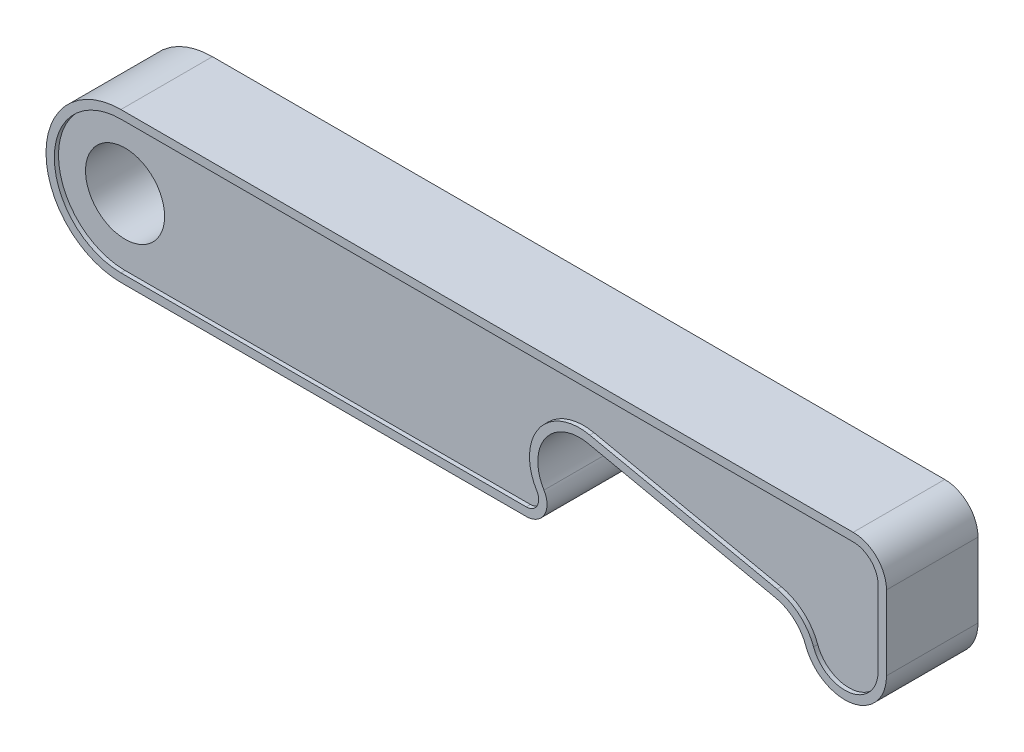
ISO-10303-21;
HEADER;
FILE_DESCRIPTION(('STEP AP214'),'2;1');
FILE_NAME('part.step','',(''),(''),'','','');
FILE_SCHEMA(('AUTOMOTIVE_DESIGN { 1 0 10303 214 1 1 1 1 }'));
ENDSEC;
DATA;
#1=APPLICATION_CONTEXT('core data for automotive mechanical design processes');
#2=APPLICATION_PROTOCOL_DEFINITION('international standard','automotive_design',2000,#1);
#3=PRODUCT_CONTEXT('',#1,'mechanical');
#4=PRODUCT('Part','Part','',(#3));
#5=PRODUCT_RELATED_PRODUCT_CATEGORY('part','',(#4));
#6=PRODUCT_DEFINITION_FORMATION('','',#4);
#7=PRODUCT_DEFINITION_CONTEXT('part definition',#1,'design');
#8=PRODUCT_DEFINITION('design','',#6,#7);
#9=PRODUCT_DEFINITION_SHAPE('','',#8);
#10=(LENGTH_UNIT() NAMED_UNIT(*) SI_UNIT(.MILLI.,.METRE.));
#11=(NAMED_UNIT(*) PLANE_ANGLE_UNIT() SI_UNIT($,.RADIAN.));
#12=(NAMED_UNIT(*) SI_UNIT($,.STERADIAN.) SOLID_ANGLE_UNIT());
#13=UNCERTAINTY_MEASURE_WITH_UNIT(LENGTH_MEASURE(1.E-05),#10,'distance_accuracy_value','');
#14=(GEOMETRIC_REPRESENTATION_CONTEXT(3) GLOBAL_UNCERTAINTY_ASSIGNED_CONTEXT((#13)) GLOBAL_UNIT_ASSIGNED_CONTEXT((#10,
#11,#12)) REPRESENTATION_CONTEXT('',''));
#15=CARTESIAN_POINT('',(0.,0.,0.));
#16=DIRECTION('',(0.,0.,1.));
#17=DIRECTION('',(1.,0.,0.));
#18=AXIS2_PLACEMENT_3D('',#15,#16,#17);
#19=CARTESIAN_POINT('',(0.,0.,5.));
#20=DIRECTION('',(0.,0.,1.));
#21=DIRECTION('',(1.,0.,0.));
#22=AXIS2_PLACEMENT_3D('',#19,#20,#21);
#23=PLANE('',#22);
#24=CARTESIAN_POINT('',(0.,0.,5.));
#25=DIRECTION('',(0.,0.,1.));
#26=DIRECTION('',(1.,0.,0.));
#27=AXIS2_PLACEMENT_3D('',#24,#25,#26);
#28=CIRCLE('',#27,8.00000000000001);
#29=CARTESIAN_POINT('',(0.,-8.,5.));
#30=VERTEX_POINT('',#29);
#31=CARTESIAN_POINT('',(0.,8.00000000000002,5.));
#32=VERTEX_POINT('',#31);
#33=EDGE_CURVE('E63',#30,#32,#28,.F.);
#34=ORIENTED_EDGE('',*,*,#33,.F.);
#35=DIRECTION('',(-1.,0.,0.));
#36=VECTOR('',#35,1.);
#37=CARTESIAN_POINT('',(0.,-8.,5.));
#38=LINE('',#37,#36);
#39=CARTESIAN_POINT('',(48.7109745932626,-7.99999999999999,5.));
#40=VERTEX_POINT('',#39);
#41=EDGE_CURVE('E67',#40,#30,#38,.T.);
#42=ORIENTED_EDGE('',*,*,#41,.F.);
#43=CARTESIAN_POINT('',(48.7109745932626,-6.49999999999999,5.));
#44=DIRECTION('',(0.,0.,1.));
#45=DIRECTION('',(1.,0.,0.));
#46=AXIS2_PLACEMENT_3D('',#43,#44,#45);
#47=CIRCLE('',#46,1.5);
#48=CARTESIAN_POINT('',(49.9893944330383,-5.71537097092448,5.));
#49=VERTEX_POINT('',#48);
#50=EDGE_CURVE('E484',#49,#40,#47,.F.);
#51=ORIENTED_EDGE('',*,*,#50,.F.);
#52=CARTESIAN_POINT('',(55.1030737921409,-2.57685485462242,5.));
#53=DIRECTION('',(0.,0.,1.));
#54=DIRECTION('',(1.,0.,0.));
#55=AXIS2_PLACEMENT_3D('',#52,#53,#54);
#56=CIRCLE('',#55,6.);
#57=CARTESIAN_POINT('',(56.3505439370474,3.29203074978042,5.));
#58=VERTEX_POINT('',#57);
#59=EDGE_CURVE('E480',#58,#49,#56,.T.);
#60=ORIENTED_EDGE('',*,*,#59,.F.);
#61=DIRECTION('',(-0.978147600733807,0.207911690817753,0.));
#62=VECTOR('',#61,1.);
#63=CARTESIAN_POINT('',(3.10537501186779,14.6096407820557,5.));
#64=LINE('',#63,#62);
#65=CARTESIAN_POINT('',(78.8505439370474,-1.49049188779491,5.));
#66=VERTEX_POINT('',#65);
#67=EDGE_CURVE('E476',#66,#58,#64,.T.);
#68=ORIENTED_EDGE('',*,*,#67,.F.);
#69=CARTESIAN_POINT('',(77.6030737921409,-7.35937749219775,5.));
#70=DIRECTION('',(0.,0.,1.));
#71=DIRECTION('',(1.,0.,0.));
#72=AXIS2_PLACEMENT_3D('',#69,#70,#71);
#73=CIRCLE('',#72,6.);
#74=CARTESIAN_POINT('',(83.2412295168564,-5.30725663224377,5.));
#75=VERTEX_POINT('',#74);
#76=EDGE_CURVE('E472',#75,#66,#73,.T.);
#77=ORIENTED_EDGE('',*,*,#76,.F.);
#78=CARTESIAN_POINT('',(87.,-3.93917605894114,5.));
#79=DIRECTION('',(0.,0.,1.));
#80=DIRECTION('',(1.,0.,0.));
#81=AXIS2_PLACEMENT_3D('',#78,#79,#80);
#82=CIRCLE('',#81,4.);
#83=CARTESIAN_POINT('',(91.,-3.93917605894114,5.));
#84=VERTEX_POINT('',#83);
#85=EDGE_CURVE('E468',#84,#75,#82,.F.);
#86=ORIENTED_EDGE('',*,*,#85,.F.);
#87=DIRECTION('',(0.,-1.,0.));
#88=VECTOR('',#87,1.);
#89=CARTESIAN_POINT('',(91.,1.41274618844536E-13,5.));
#90=LINE('',#89,#88);
#91=CARTESIAN_POINT('',(91.,5.00000000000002,5.));
#92=VERTEX_POINT('',#91);
#93=EDGE_CURVE('E464',#92,#84,#90,.T.);
#94=ORIENTED_EDGE('',*,*,#93,.F.);
#95=CARTESIAN_POINT('',(88.,5.00000000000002,5.));
#96=DIRECTION('',(0.,0.,1.));
#97=DIRECTION('',(1.,0.,0.));
#98=AXIS2_PLACEMENT_3D('',#95,#96,#97);
#99=CIRCLE('',#98,3.);
#100=CARTESIAN_POINT('',(88.,8.00000000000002,5.));
#101=VERTEX_POINT('',#100);
#102=EDGE_CURVE('E460',#101,#92,#99,.F.);
#103=ORIENTED_EDGE('',*,*,#102,.F.);
#104=DIRECTION('',(1.,0.,0.));
#105=VECTOR('',#104,1.);
#106=CARTESIAN_POINT('',(0.,8.00000000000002,5.));
#107=LINE('',#106,#105);
#108=EDGE_CURVE('E418',#32,#101,#107,.T.);
#109=ORIENTED_EDGE('',*,*,#108,.F.);
#110=EDGE_LOOP('',(#34,#42,#51,#60,#68,#77,#86,#94,#103,#109));
#111=FACE_BOUND('',#110,.T.);
#112=CARTESIAN_POINT('',(0.,0.,5.));
#113=DIRECTION('',(0.,0.,1.));
#114=DIRECTION('',(1.,0.,0.));
#115=AXIS2_PLACEMENT_3D('',#112,#113,#114);
#116=CIRCLE('',#115,4.75);
#117=CARTESIAN_POINT('',(4.75,0.,5.));
#118=VERTEX_POINT('',#117);
#119=EDGE_CURVE('E492',#118,#118,#116,.T.);
#120=ORIENTED_EDGE('',*,*,#119,.F.);
#121=EDGE_LOOP('',(#120));
#122=FACE_BOUND('',#121,.T.);
#123=ADVANCED_FACE('F47',(#111,#122),#23,.T.);
#124=CARTESIAN_POINT('',(0.,0.,-5.));
#125=DIRECTION('',(0.,0.,1.));
#126=DIRECTION('',(1.,0.,0.));
#127=AXIS2_PLACEMENT_3D('',#124,#125,#126);
#128=PLANE('',#127);
#129=DIRECTION('',(-1.,0.,0.));
#130=VECTOR('',#129,1.);
#131=CARTESIAN_POINT('',(0.,-8.,-5.));
#132=LINE('',#131,#130);
#133=CARTESIAN_POINT('',(48.7109745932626,-8.,-5.));
#134=VERTEX_POINT('',#133);
#135=CARTESIAN_POINT('',(0.,-8.,-5.));
#136=VERTEX_POINT('',#135);
#137=EDGE_CURVE('E56',#134,#136,#132,.T.);
#138=ORIENTED_EDGE('',*,*,#137,.T.);
#139=CARTESIAN_POINT('',(0.,0.,-5.));
#140=DIRECTION('',(0.,0.,1.));
#141=DIRECTION('',(1.,0.,0.));
#142=AXIS2_PLACEMENT_3D('',#139,#140,#141);
#143=CIRCLE('',#142,8.00000000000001);
#144=CARTESIAN_POINT('',(0.,8.00000000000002,-5.));
#145=VERTEX_POINT('',#144);
#146=EDGE_CURVE('E11',#136,#145,#143,.F.);
#147=ORIENTED_EDGE('',*,*,#146,.T.);
#148=DIRECTION('',(1.,0.,0.));
#149=VECTOR('',#148,1.);
#150=CARTESIAN_POINT('',(0.,8.00000000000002,-5.));
#151=LINE('',#150,#149);
#152=CARTESIAN_POINT('',(88.,8.00000000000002,-5.));
#153=VERTEX_POINT('',#152);
#154=EDGE_CURVE('E529',#145,#153,#151,.T.);
#155=ORIENTED_EDGE('',*,*,#154,.T.);
#156=CARTESIAN_POINT('',(88.,5.00000000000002,-5.));
#157=DIRECTION('',(0.,0.,1.));
#158=DIRECTION('',(1.,0.,0.));
#159=AXIS2_PLACEMENT_3D('',#156,#157,#158);
#160=CIRCLE('',#159,3.);
#161=CARTESIAN_POINT('',(91.,5.00000000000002,-5.));
#162=VERTEX_POINT('',#161);
#163=EDGE_CURVE('E533',#153,#162,#160,.F.);
#164=ORIENTED_EDGE('',*,*,#163,.T.);
#165=DIRECTION('',(0.,-1.,0.));
#166=VECTOR('',#165,1.);
#167=CARTESIAN_POINT('',(91.,1.41274618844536E-13,-5.));
#168=LINE('',#167,#166);
#169=CARTESIAN_POINT('',(91.,-3.93917605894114,-5.));
#170=VERTEX_POINT('',#169);
#171=EDGE_CURVE('E537',#162,#170,#168,.T.);
#172=ORIENTED_EDGE('',*,*,#171,.T.);
#173=CARTESIAN_POINT('',(87.,-3.93917605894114,-5.));
#174=DIRECTION('',(0.,0.,1.));
#175=DIRECTION('',(1.,0.,0.));
#176=AXIS2_PLACEMENT_3D('',#173,#174,#175);
#177=CIRCLE('',#176,4.);
#178=CARTESIAN_POINT('',(83.2412295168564,-5.30725663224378,-5.));
#179=VERTEX_POINT('',#178);
#180=EDGE_CURVE('E541',#170,#179,#177,.F.);
#181=ORIENTED_EDGE('',*,*,#180,.T.);
#182=CARTESIAN_POINT('',(77.6030737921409,-7.35937749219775,-5.));
#183=DIRECTION('',(0.,0.,1.));
#184=DIRECTION('',(1.,0.,0.));
#185=AXIS2_PLACEMENT_3D('',#182,#183,#184);
#186=CIRCLE('',#185,6.);
#187=CARTESIAN_POINT('',(78.8505439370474,-1.49049188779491,-5.));
#188=VERTEX_POINT('',#187);
#189=EDGE_CURVE('E545',#179,#188,#186,.T.);
#190=ORIENTED_EDGE('',*,*,#189,.T.);
#191=DIRECTION('',(-0.978147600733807,0.207911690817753,0.));
#192=VECTOR('',#191,1.);
#193=CARTESIAN_POINT('',(3.10537501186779,14.6096407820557,-5.));
#194=LINE('',#193,#192);
#195=CARTESIAN_POINT('',(56.3505439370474,3.29203074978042,-5.));
#196=VERTEX_POINT('',#195);
#197=EDGE_CURVE('E549',#188,#196,#194,.T.);
#198=ORIENTED_EDGE('',*,*,#197,.T.);
#199=CARTESIAN_POINT('',(55.1030737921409,-2.57685485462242,-5.));
#200=DIRECTION('',(0.,0.,1.));
#201=DIRECTION('',(1.,0.,0.));
#202=AXIS2_PLACEMENT_3D('',#199,#200,#201);
#203=CIRCLE('',#202,6.);
#204=CARTESIAN_POINT('',(49.9893944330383,-5.71537097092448,-5.));
#205=VERTEX_POINT('',#204);
#206=EDGE_CURVE('E553',#196,#205,#203,.T.);
#207=ORIENTED_EDGE('',*,*,#206,.T.);
#208=CARTESIAN_POINT('',(48.7109745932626,-6.49999999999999,-5.));
#209=DIRECTION('',(0.,0.,1.));
#210=DIRECTION('',(1.,0.,0.));
#211=AXIS2_PLACEMENT_3D('',#208,#209,#210);
#212=CIRCLE('',#211,1.5);
#213=EDGE_CURVE('E557',#205,#134,#212,.F.);
#214=ORIENTED_EDGE('',*,*,#213,.T.);
#215=EDGE_LOOP('',(#138,#147,#155,#164,#172,#181,#190,#198,#207,#214));
#216=FACE_BOUND('',#215,.T.);
#217=CARTESIAN_POINT('',(0.,0.,-5.));
#218=DIRECTION('',(0.,0.,1.));
#219=DIRECTION('',(1.,0.,0.));
#220=AXIS2_PLACEMENT_3D('',#217,#218,#219);
#221=CIRCLE('',#220,4.75);
#222=CARTESIAN_POINT('',(4.75,0.,-5.));
#223=VERTEX_POINT('',#222);
#224=EDGE_CURVE('E491',#223,#223,#221,.T.);
#225=ORIENTED_EDGE('',*,*,#224,.T.);
#226=EDGE_LOOP('',(#225));
#227=FACE_BOUND('',#226,.T.);
#228=ADVANCED_FACE('F563',(#216,#227),#128,.F.);
#229=CARTESIAN_POINT('',(0.,0.,5.));
#230=DIRECTION('',(0.,0.,-1.));
#231=DIRECTION('',(-1.,0.,0.));
#232=AXIS2_PLACEMENT_3D('',#229,#230,#231);
#233=CYLINDRICAL_SURFACE('',#232,4.75);
#234=ORIENTED_EDGE('',*,*,#119,.T.);
#235=EDGE_LOOP('',(#234));
#236=FACE_BOUND('',#235,.T.);
#237=ORIENTED_EDGE('',*,*,#224,.F.);
#238=EDGE_LOOP('',(#237));
#239=FACE_BOUND('',#238,.T.);
#240=ADVANCED_FACE('F636',(#236,#239),#233,.F.);
#241=CARTESIAN_POINT('',(0.,0.,-5.5));
#242=DIRECTION('',(0.,0.,1.));
#243=DIRECTION('',(1.,0.,0.));
#244=AXIS2_PLACEMENT_3D('',#241,#242,#243);
#245=PLANE('',#244);
#246=CARTESIAN_POINT('',(0.,0.,-5.5));
#247=DIRECTION('',(0.,0.,1.));
#248=DIRECTION('',(1.,0.,0.));
#249=AXIS2_PLACEMENT_3D('',#246,#247,#248);
#250=CIRCLE('',#249,9.);
#251=CARTESIAN_POINT('',(0.,9.,-5.5));
#252=VERTEX_POINT('',#251);
#253=CARTESIAN_POINT('',(0.,-9.,-5.5));
#254=VERTEX_POINT('',#253);
#255=EDGE_CURVE('E262',#252,#254,#250,.T.);
#256=ORIENTED_EDGE('',*,*,#255,.F.);
#257=DIRECTION('',(-1.,0.,0.));
#258=VECTOR('',#257,1.);
#259=CARTESIAN_POINT('',(88.,9.00000000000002,-5.5));
#260=LINE('',#259,#258);
#261=CARTESIAN_POINT('',(88.,9.00000000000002,-5.5));
#262=VERTEX_POINT('',#261);
#263=EDGE_CURVE('E382',#262,#252,#260,.T.);
#264=ORIENTED_EDGE('',*,*,#263,.F.);
#265=CARTESIAN_POINT('',(88.,5.00000000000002,-5.5));
#266=DIRECTION('',(0.,0.,1.));
#267=DIRECTION('',(1.,0.,0.));
#268=AXIS2_PLACEMENT_3D('',#265,#266,#267);
#269=CIRCLE('',#268,4.);
#270=CARTESIAN_POINT('',(92.,5.00000000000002,-5.5));
#271=VERTEX_POINT('',#270);
#272=EDGE_CURVE('E450',#271,#262,#269,.T.);
#273=ORIENTED_EDGE('',*,*,#272,.F.);
#274=DIRECTION('',(0.,1.,0.));
#275=VECTOR('',#274,1.);
#276=CARTESIAN_POINT('',(92.,-3.93917605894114,-5.5));
#277=LINE('',#276,#275);
#278=CARTESIAN_POINT('',(92.,-3.93917605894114,-5.5));
#279=VERTEX_POINT('',#278);
#280=EDGE_CURVE('E446',#279,#271,#277,.T.);
#281=ORIENTED_EDGE('',*,*,#280,.F.);
#282=CARTESIAN_POINT('',(87.,-3.93917605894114,-5.5));
#283=DIRECTION('',(0.,0.,1.));
#284=DIRECTION('',(1.,0.,0.));
#285=AXIS2_PLACEMENT_3D('',#282,#283,#284);
#286=CIRCLE('',#285,5.);
#287=CARTESIAN_POINT('',(82.3015368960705,-5.64927677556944,-5.5));
#288=VERTEX_POINT('',#287);
#289=EDGE_CURVE('E442',#288,#279,#286,.T.);
#290=ORIENTED_EDGE('',*,*,#289,.F.);
#291=CARTESIAN_POINT('',(77.6030737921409,-7.35937749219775,-5.5));
#292=DIRECTION('',(0.,0.,-1.));
#293=DIRECTION('',(1.,0.,0.));
#294=AXIS2_PLACEMENT_3D('',#291,#292,#293);
#295=CIRCLE('',#294,5.);
#296=CARTESIAN_POINT('',(78.6426322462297,-2.46863948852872,-5.5));
#297=VERTEX_POINT('',#296);
#298=EDGE_CURVE('E438',#297,#288,#295,.T.);
#299=ORIENTED_EDGE('',*,*,#298,.F.);
#300=DIRECTION('',(0.978147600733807,-0.207911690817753,0.));
#301=VECTOR('',#300,1.);
#302=CARTESIAN_POINT('',(56.1426322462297,2.31388314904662,-5.5));
#303=LINE('',#302,#301);
#304=CARTESIAN_POINT('',(56.1426322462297,2.31388314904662,-5.5));
#305=VERTEX_POINT('',#304);
#306=EDGE_CURVE('E434',#305,#297,#303,.T.);
#307=ORIENTED_EDGE('',*,*,#306,.F.);
#308=CARTESIAN_POINT('',(55.1030737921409,-2.57685485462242,-5.5));
#309=DIRECTION('',(0.,0.,-1.));
#310=DIRECTION('',(1.,0.,0.));
#311=AXIS2_PLACEMENT_3D('',#308,#309,#310);
#312=CIRCLE('',#311,5.);
#313=CARTESIAN_POINT('',(50.8416743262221,-5.1922849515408,-5.5));
#314=VERTEX_POINT('',#313);
#315=EDGE_CURVE('E430',#314,#305,#312,.T.);
#316=ORIENTED_EDGE('',*,*,#315,.F.);
#317=CARTESIAN_POINT('',(48.7109745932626,-6.49999999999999,-5.5));
#318=DIRECTION('',(0.,0.,1.));
#319=DIRECTION('',(1.,0.,0.));
#320=AXIS2_PLACEMENT_3D('',#317,#318,#319);
#321=CIRCLE('',#320,2.5);
#322=CARTESIAN_POINT('',(48.7109745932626,-8.99999999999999,-5.5));
#323=VERTEX_POINT('',#322);
#324=EDGE_CURVE('E426',#323,#314,#321,.T.);
#325=ORIENTED_EDGE('',*,*,#324,.F.);
#326=DIRECTION('',(1.,0.,0.));
#327=VECTOR('',#326,1.);
#328=CARTESIAN_POINT('',(0.,-9.,-5.5));
#329=LINE('',#328,#327);
#330=EDGE_CURVE('E422',#254,#323,#329,.T.);
#331=ORIENTED_EDGE('',*,*,#330,.F.);
#332=EDGE_LOOP('',(#256,#264,#273,#281,#290,#299,#307,#316,#325,#331));
#333=FACE_BOUND('',#332,.T.);
#334=CARTESIAN_POINT('',(0.,0.,-5.5));
#335=DIRECTION('',(0.,0.,1.));
#336=DIRECTION('',(1.,0.,0.));
#337=AXIS2_PLACEMENT_3D('',#334,#335,#336);
#338=CIRCLE('',#337,8.00000000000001);
#339=CARTESIAN_POINT('',(0.,8.00000000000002,-5.5));
#340=VERTEX_POINT('',#339);
#341=CARTESIAN_POINT('',(0.,-8.,-5.5));
#342=VERTEX_POINT('',#341);
#343=EDGE_CURVE('E297',#340,#342,#338,.T.);
#344=ORIENTED_EDGE('',*,*,#343,.T.);
#345=DIRECTION('',(1.,0.,0.));
#346=VECTOR('',#345,1.);
#347=CARTESIAN_POINT('',(0.,-8.,-5.5));
#348=LINE('',#347,#346);
#349=CARTESIAN_POINT('',(48.7109745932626,-8.,-5.5));
#350=VERTEX_POINT('',#349);
#351=EDGE_CURVE('E301',#342,#350,#348,.T.);
#352=ORIENTED_EDGE('',*,*,#351,.T.);
#353=CARTESIAN_POINT('',(48.7109745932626,-6.49999999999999,-5.5));
#354=DIRECTION('',(0.,0.,1.));
#355=DIRECTION('',(1.,0.,0.));
#356=AXIS2_PLACEMENT_3D('',#353,#354,#355);
#357=CIRCLE('',#356,1.5);
#358=CARTESIAN_POINT('',(49.9893944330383,-5.71537097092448,-5.5));
#359=VERTEX_POINT('',#358);
#360=EDGE_CURVE('E305',#350,#359,#357,.T.);
#361=ORIENTED_EDGE('',*,*,#360,.T.);
#362=CARTESIAN_POINT('',(55.1030737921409,-2.57685485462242,-5.5));
#363=DIRECTION('',(0.,0.,-1.));
#364=DIRECTION('',(1.,0.,0.));
#365=AXIS2_PLACEMENT_3D('',#362,#363,#364);
#366=CIRCLE('',#365,6.);
#367=CARTESIAN_POINT('',(56.3505439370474,3.29203074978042,-5.5));
#368=VERTEX_POINT('',#367);
#369=EDGE_CURVE('E309',#359,#368,#366,.T.);
#370=ORIENTED_EDGE('',*,*,#369,.T.);
#371=DIRECTION('',(0.978147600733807,-0.207911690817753,0.));
#372=VECTOR('',#371,1.);
#373=CARTESIAN_POINT('',(56.3505439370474,3.29203074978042,-5.5));
#374=LINE('',#373,#372);
#375=CARTESIAN_POINT('',(78.8505439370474,-1.49049188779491,-5.5));
#376=VERTEX_POINT('',#375);
#377=EDGE_CURVE('E313',#368,#376,#374,.T.);
#378=ORIENTED_EDGE('',*,*,#377,.T.);
#379=CARTESIAN_POINT('',(77.6030737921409,-7.35937749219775,-5.5));
#380=DIRECTION('',(0.,0.,-1.));
#381=DIRECTION('',(1.,0.,0.));
#382=AXIS2_PLACEMENT_3D('',#379,#380,#381);
#383=CIRCLE('',#382,6.);
#384=CARTESIAN_POINT('',(83.2412295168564,-5.30725663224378,-5.5));
#385=VERTEX_POINT('',#384);
#386=EDGE_CURVE('E317',#376,#385,#383,.T.);
#387=ORIENTED_EDGE('',*,*,#386,.T.);
#388=CARTESIAN_POINT('',(87.,-3.93917605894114,-5.5));
#389=DIRECTION('',(0.,0.,1.));
#390=DIRECTION('',(1.,0.,0.));
#391=AXIS2_PLACEMENT_3D('',#388,#389,#390);
#392=CIRCLE('',#391,4.);
#393=CARTESIAN_POINT('',(91.,-3.93917605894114,-5.5));
#394=VERTEX_POINT('',#393);
#395=EDGE_CURVE('E321',#385,#394,#392,.T.);
#396=ORIENTED_EDGE('',*,*,#395,.T.);
#397=DIRECTION('',(0.,1.,0.));
#398=VECTOR('',#397,1.);
#399=CARTESIAN_POINT('',(91.,-3.93917605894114,-5.5));
#400=LINE('',#399,#398);
#401=CARTESIAN_POINT('',(91.,5.00000000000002,-5.5));
#402=VERTEX_POINT('',#401);
#403=EDGE_CURVE('E325',#394,#402,#400,.T.);
#404=ORIENTED_EDGE('',*,*,#403,.T.);
#405=CARTESIAN_POINT('',(88.,5.00000000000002,-5.5));
#406=DIRECTION('',(0.,0.,1.));
#407=DIRECTION('',(1.,0.,0.));
#408=AXIS2_PLACEMENT_3D('',#405,#406,#407);
#409=CIRCLE('',#408,3.);
#410=CARTESIAN_POINT('',(88.,8.00000000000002,-5.5));
#411=VERTEX_POINT('',#410);
#412=EDGE_CURVE('E329',#402,#411,#409,.T.);
#413=ORIENTED_EDGE('',*,*,#412,.T.);
#414=DIRECTION('',(-1.,0.,0.));
#415=VECTOR('',#414,1.);
#416=CARTESIAN_POINT('',(88.,8.00000000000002,-5.5));
#417=LINE('',#416,#415);
#418=EDGE_CURVE('E255',#411,#340,#417,.T.);
#419=ORIENTED_EDGE('',*,*,#418,.T.);
#420=EDGE_LOOP('',(#344,#352,#361,#370,#378,#387,#396,#404,#413,#419));
#421=FACE_BOUND('',#420,.T.);
#422=ADVANCED_FACE('F592',(#333,#421),#245,.F.);
#423=CARTESIAN_POINT('',(88.,8.00000000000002,5.5));
#424=DIRECTION('',(0.,-1.,0.));
#425=DIRECTION('',(1.,0.,0.));
#426=AXIS2_PLACEMENT_3D('',#423,#424,#425);
#427=PLANE('',#426);
#428=ORIENTED_EDGE('',*,*,#154,.F.);
#429=DIRECTION('',(0.,0.,-1.));
#430=VECTOR('',#429,1.);
#431=CARTESIAN_POINT('',(0.,8.00000000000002,5.5));
#432=LINE('',#431,#430);
#433=EDGE_CURVE('E296',#145,#340,#432,.T.);
#434=ORIENTED_EDGE('',*,*,#433,.T.);
#435=ORIENTED_EDGE('',*,*,#418,.F.);
#436=DIRECTION('',(0.,0.,-1.));
#437=VECTOR('',#436,1.);
#438=CARTESIAN_POINT('',(88.,8.00000000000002,5.5));
#439=LINE('',#438,#437);
#440=EDGE_CURVE('E338',#153,#411,#439,.T.);
#441=ORIENTED_EDGE('',*,*,#440,.F.);
#442=EDGE_LOOP('',(#428,#434,#435,#441));
#443=FACE_BOUND('',#442,.T.);
#444=ADVANCED_FACE('F588',(#443),#427,.T.);
#445=CARTESIAN_POINT('',(88.,5.00000000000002,5.5));
#446=DIRECTION('',(0.,0.,-1.));
#447=DIRECTION('',(-1.,0.,0.));
#448=AXIS2_PLACEMENT_3D('',#445,#446,#447);
#449=CYLINDRICAL_SURFACE('',#448,3.);
#450=ORIENTED_EDGE('',*,*,#163,.F.);
#451=ORIENTED_EDGE('',*,*,#440,.T.);
#452=ORIENTED_EDGE('',*,*,#412,.F.);
#453=DIRECTION('',(0.,0.,-1.));
#454=VECTOR('',#453,1.);
#455=CARTESIAN_POINT('',(91.,5.00000000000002,5.5));
#456=LINE('',#455,#454);
#457=EDGE_CURVE('E343',#162,#402,#456,.T.);
#458=ORIENTED_EDGE('',*,*,#457,.F.);
#459=EDGE_LOOP('',(#450,#451,#452,#458));
#460=FACE_BOUND('',#459,.T.);
#461=ADVANCED_FACE('F598',(#460),#449,.F.);
#462=CARTESIAN_POINT('',(91.,-3.93917605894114,5.5));
#463=DIRECTION('',(-1.,0.,0.));
#464=DIRECTION('',(0.,-1.,0.));
#465=AXIS2_PLACEMENT_3D('',#462,#463,#464);
#466=PLANE('',#465);
#467=ORIENTED_EDGE('',*,*,#171,.F.);
#468=ORIENTED_EDGE('',*,*,#457,.T.);
#469=ORIENTED_EDGE('',*,*,#403,.F.);
#470=DIRECTION('',(0.,0.,-1.));
#471=VECTOR('',#470,1.);
#472=CARTESIAN_POINT('',(91.,-3.93917605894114,5.5));
#473=LINE('',#472,#471);
#474=EDGE_CURVE('E348',#170,#394,#473,.T.);
#475=ORIENTED_EDGE('',*,*,#474,.F.);
#476=EDGE_LOOP('',(#467,#468,#469,#475));
#477=FACE_BOUND('',#476,.T.);
#478=ADVANCED_FACE('F601',(#477),#466,.T.);
#479=CARTESIAN_POINT('',(87.,-3.93917605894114,5.5));
#480=DIRECTION('',(0.,0.,-1.));
#481=DIRECTION('',(-1.,0.,0.));
#482=AXIS2_PLACEMENT_3D('',#479,#480,#481);
#483=CYLINDRICAL_SURFACE('',#482,4.);
#484=ORIENTED_EDGE('',*,*,#180,.F.);
#485=ORIENTED_EDGE('',*,*,#474,.T.);
#486=ORIENTED_EDGE('',*,*,#395,.F.);
#487=DIRECTION('',(0.,0.,-1.));
#488=VECTOR('',#487,1.);
#489=CARTESIAN_POINT('',(83.2412295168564,-5.30725663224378,5.5));
#490=LINE('',#489,#488);
#491=EDGE_CURVE('E353',#179,#385,#490,.T.);
#492=ORIENTED_EDGE('',*,*,#491,.F.);
#493=EDGE_LOOP('',(#484,#485,#486,#492));
#494=FACE_BOUND('',#493,.T.);
#495=ADVANCED_FACE('F604',(#494),#483,.F.);
#496=CARTESIAN_POINT('',(77.6030737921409,-7.35937749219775,5.5));
#497=DIRECTION('',(0.,0.,-1.));
#498=DIRECTION('',(-1.,0.,0.));
#499=AXIS2_PLACEMENT_3D('',#496,#497,#498);
#500=CYLINDRICAL_SURFACE('',#499,6.);
#501=ORIENTED_EDGE('',*,*,#189,.F.);
#502=ORIENTED_EDGE('',*,*,#491,.T.);
#503=ORIENTED_EDGE('',*,*,#386,.F.);
#504=DIRECTION('',(0.,0.,-1.));
#505=VECTOR('',#504,1.);
#506=CARTESIAN_POINT('',(78.8505439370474,-1.49049188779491,5.5));
#507=LINE('',#506,#505);
#508=EDGE_CURVE('E358',#188,#376,#507,.T.);
#509=ORIENTED_EDGE('',*,*,#508,.F.);
#510=EDGE_LOOP('',(#501,#502,#503,#509));
#511=FACE_BOUND('',#510,.T.);
#512=ADVANCED_FACE('F608',(#511),#500,.T.);
#513=CARTESIAN_POINT('',(56.3505439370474,3.29203074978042,5.5));
#514=DIRECTION('',(0.207911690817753,0.978147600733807,0.));
#515=DIRECTION('',(-0.978147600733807,0.207911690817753,0.));
#516=AXIS2_PLACEMENT_3D('',#513,#514,#515);
#517=PLANE('',#516);
#518=ORIENTED_EDGE('',*,*,#197,.F.);
#519=ORIENTED_EDGE('',*,*,#508,.T.);
#520=ORIENTED_EDGE('',*,*,#377,.F.);
#521=DIRECTION('',(0.,0.,-1.));
#522=VECTOR('',#521,1.);
#523=CARTESIAN_POINT('',(56.3505439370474,3.29203074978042,5.5));
#524=LINE('',#523,#522);
#525=EDGE_CURVE('E363',#196,#368,#524,.T.);
#526=ORIENTED_EDGE('',*,*,#525,.F.);
#527=EDGE_LOOP('',(#518,#519,#520,#526));
#528=FACE_BOUND('',#527,.T.);
#529=ADVANCED_FACE('F612',(#528),#517,.T.);
#530=CARTESIAN_POINT('',(55.1030737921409,-2.57685485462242,5.5));
#531=DIRECTION('',(0.,0.,-1.));
#532=DIRECTION('',(-1.,0.,0.));
#533=AXIS2_PLACEMENT_3D('',#530,#531,#532);
#534=CYLINDRICAL_SURFACE('',#533,6.);
#535=ORIENTED_EDGE('',*,*,#206,.F.);
#536=ORIENTED_EDGE('',*,*,#525,.T.);
#537=ORIENTED_EDGE('',*,*,#369,.F.);
#538=DIRECTION('',(0.,0.,-1.));
#539=VECTOR('',#538,1.);
#540=CARTESIAN_POINT('',(49.9893944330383,-5.71537097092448,5.5));
#541=LINE('',#540,#539);
#542=EDGE_CURVE('E368',#205,#359,#541,.T.);
#543=ORIENTED_EDGE('',*,*,#542,.F.);
#544=EDGE_LOOP('',(#535,#536,#537,#543));
#545=FACE_BOUND('',#544,.T.);
#546=ADVANCED_FACE('F616',(#545),#534,.T.);
#547=CARTESIAN_POINT('',(48.7109745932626,-6.49999999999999,5.5));
#548=DIRECTION('',(0.,0.,-1.));
#549=DIRECTION('',(-1.,0.,0.));
#550=AXIS2_PLACEMENT_3D('',#547,#548,#549);
#551=CYLINDRICAL_SURFACE('',#550,1.5);
#552=ORIENTED_EDGE('',*,*,#213,.F.);
#553=ORIENTED_EDGE('',*,*,#542,.T.);
#554=ORIENTED_EDGE('',*,*,#360,.F.);
#555=DIRECTION('',(0.,0.,-1.));
#556=VECTOR('',#555,1.);
#557=CARTESIAN_POINT('',(48.7109745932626,-8.,5.5));
#558=LINE('',#557,#556);
#559=EDGE_CURVE('E373',#134,#350,#558,.T.);
#560=ORIENTED_EDGE('',*,*,#559,.F.);
#561=EDGE_LOOP('',(#552,#553,#554,#560));
#562=FACE_BOUND('',#561,.T.);
#563=ADVANCED_FACE('F572',(#562),#551,.F.);
#564=CARTESIAN_POINT('',(0.,-8.,5.5));
#565=DIRECTION('',(0.,1.,0.));
#566=DIRECTION('',(0.,0.,1.));
#567=AXIS2_PLACEMENT_3D('',#564,#565,#566);
#568=PLANE('',#567);
#569=ORIENTED_EDGE('',*,*,#137,.F.);
#570=ORIENTED_EDGE('',*,*,#559,.T.);
#571=ORIENTED_EDGE('',*,*,#351,.F.);
#572=DIRECTION('',(0.,0.,-1.));
#573=VECTOR('',#572,1.);
#574=CARTESIAN_POINT('',(0.,-8.,5.5));
#575=LINE('',#574,#573);
#576=EDGE_CURVE('E263',#136,#342,#575,.T.);
#577=ORIENTED_EDGE('',*,*,#576,.F.);
#578=EDGE_LOOP('',(#569,#570,#571,#577));
#579=FACE_BOUND('',#578,.T.);
#580=ADVANCED_FACE('F568',(#579),#568,.T.);
#581=CARTESIAN_POINT('',(0.,0.,5.5));
#582=DIRECTION('',(0.,0.,-1.));
#583=DIRECTION('',(-1.,0.,0.));
#584=AXIS2_PLACEMENT_3D('',#581,#582,#583);
#585=CYLINDRICAL_SURFACE('',#584,8.00000000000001);
#586=ORIENTED_EDGE('',*,*,#146,.F.);
#587=ORIENTED_EDGE('',*,*,#576,.T.);
#588=ORIENTED_EDGE('',*,*,#343,.F.);
#589=ORIENTED_EDGE('',*,*,#433,.F.);
#590=EDGE_LOOP('',(#586,#587,#588,#589));
#591=FACE_BOUND('',#590,.T.);
#592=ADVANCED_FACE('F590',(#591),#585,.F.);
#593=CARTESIAN_POINT('',(0.,9.,5.));
#594=DIRECTION('',(0.,-1.,0.));
#595=DIRECTION('',(1.,0.,0.));
#596=AXIS2_PLACEMENT_3D('',#593,#594,#595);
#597=PLANE('',#596);
#598=DIRECTION('',(0.,0.,-1.));
#599=VECTOR('',#598,1.);
#600=CARTESIAN_POINT('',(88.,9.00000000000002,5.));
#601=LINE('',#600,#599);
#602=CARTESIAN_POINT('',(88.,9.00000000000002,5.5));
#603=VERTEX_POINT('',#602);
#604=EDGE_CURVE('E502',#603,#262,#601,.T.);
#605=ORIENTED_EDGE('',*,*,#604,.T.);
#606=ORIENTED_EDGE('',*,*,#263,.T.);
#607=DIRECTION('',(0.,0.,-1.));
#608=VECTOR('',#607,1.);
#609=CARTESIAN_POINT('',(0.,9.,5.));
#610=LINE('',#609,#608);
#611=CARTESIAN_POINT('',(0.,9.,5.5));
#612=VERTEX_POINT('',#611);
#613=EDGE_CURVE('E496',#612,#252,#610,.T.);
#614=ORIENTED_EDGE('',*,*,#613,.F.);
#615=DIRECTION('',(-1.,0.,0.));
#616=VECTOR('',#615,1.);
#617=CARTESIAN_POINT('',(88.,9.00000000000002,5.5));
#618=LINE('',#617,#616);
#619=EDGE_CURVE('E414',#603,#612,#618,.T.);
#620=ORIENTED_EDGE('',*,*,#619,.F.);
#621=EDGE_LOOP('',(#605,#606,#614,#620));
#622=FACE_BOUND('',#621,.T.);
#623=ADVANCED_FACE('F642',(#622),#597,.F.);
#624=CARTESIAN_POINT('',(88.,5.00000000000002,5.));
#625=DIRECTION('',(0.,0.,-1.));
#626=DIRECTION('',(-1.,0.,0.));
#627=AXIS2_PLACEMENT_3D('',#624,#625,#626);
#628=CYLINDRICAL_SURFACE('',#627,4.);
#629=DIRECTION('',(0.,0.,-1.));
#630=VECTOR('',#629,1.);
#631=CARTESIAN_POINT('',(92.,5.00000000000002,5.));
#632=LINE('',#631,#630);
#633=CARTESIAN_POINT('',(92.,5.00000000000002,5.5));
#634=VERTEX_POINT('',#633);
#635=EDGE_CURVE('E505',#634,#271,#632,.T.);
#636=ORIENTED_EDGE('',*,*,#635,.T.);
#637=ORIENTED_EDGE('',*,*,#272,.T.);
#638=ORIENTED_EDGE('',*,*,#604,.F.);
#639=CARTESIAN_POINT('',(88.,5.00000000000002,5.5));
#640=DIRECTION('',(0.,0.,1.));
#641=DIRECTION('',(1.,0.,0.));
#642=AXIS2_PLACEMENT_3D('',#639,#640,#641);
#643=CIRCLE('',#642,4.);
#644=EDGE_CURVE('E410',#634,#603,#643,.T.);
#645=ORIENTED_EDGE('',*,*,#644,.F.);
#646=EDGE_LOOP('',(#636,#637,#638,#645));
#647=FACE_BOUND('',#646,.T.);
#648=ADVANCED_FACE('F645',(#647),#628,.T.);
#649=CARTESIAN_POINT('',(92.,5.00000000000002,5.));
#650=DIRECTION('',(-1.,0.,0.));
#651=DIRECTION('',(0.,-1.,0.));
#652=AXIS2_PLACEMENT_3D('',#649,#650,#651);
#653=PLANE('',#652);
#654=DIRECTION('',(0.,0.,-1.));
#655=VECTOR('',#654,1.);
#656=CARTESIAN_POINT('',(92.,-3.93917605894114,5.));
#657=LINE('',#656,#655);
#658=CARTESIAN_POINT('',(92.,-3.93917605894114,5.5));
#659=VERTEX_POINT('',#658);
#660=EDGE_CURVE('E508',#659,#279,#657,.T.);
#661=ORIENTED_EDGE('',*,*,#660,.T.);
#662=ORIENTED_EDGE('',*,*,#280,.T.);
#663=ORIENTED_EDGE('',*,*,#635,.F.);
#664=DIRECTION('',(0.,1.,0.));
#665=VECTOR('',#664,1.);
#666=CARTESIAN_POINT('',(92.,-3.93917605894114,5.5));
#667=LINE('',#666,#665);
#668=EDGE_CURVE('E406',#659,#634,#667,.T.);
#669=ORIENTED_EDGE('',*,*,#668,.F.);
#670=EDGE_LOOP('',(#661,#662,#663,#669));
#671=FACE_BOUND('',#670,.T.);
#672=ADVANCED_FACE('F649',(#671),#653,.F.);
#673=CARTESIAN_POINT('',(87.,-3.93917605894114,5.));
#674=DIRECTION('',(0.,0.,-1.));
#675=DIRECTION('',(-1.,0.,0.));
#676=AXIS2_PLACEMENT_3D('',#673,#674,#675);
#677=CYLINDRICAL_SURFACE('',#676,5.);
#678=DIRECTION('',(0.,0.,-1.));
#679=VECTOR('',#678,1.);
#680=CARTESIAN_POINT('',(82.3015368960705,-5.64927677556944,5.));
#681=LINE('',#680,#679);
#682=CARTESIAN_POINT('',(82.3015368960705,-5.64927677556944,5.5));
#683=VERTEX_POINT('',#682);
#684=EDGE_CURVE('E511',#683,#288,#681,.T.);
#685=ORIENTED_EDGE('',*,*,#684,.T.);
#686=ORIENTED_EDGE('',*,*,#289,.T.);
#687=ORIENTED_EDGE('',*,*,#660,.F.);
#688=CARTESIAN_POINT('',(87.,-3.93917605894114,5.5));
#689=DIRECTION('',(0.,0.,1.));
#690=DIRECTION('',(1.,0.,0.));
#691=AXIS2_PLACEMENT_3D('',#688,#689,#690);
#692=CIRCLE('',#691,5.);
#693=EDGE_CURVE('E402',#683,#659,#692,.T.);
#694=ORIENTED_EDGE('',*,*,#693,.F.);
#695=EDGE_LOOP('',(#685,#686,#687,#694));
#696=FACE_BOUND('',#695,.T.);
#697=ADVANCED_FACE('F653',(#696),#677,.T.);
#698=CARTESIAN_POINT('',(77.6030737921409,-7.35937749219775,5.));
#699=DIRECTION('',(0.,0.,-1.));
#700=DIRECTION('',(-1.,0.,0.));
#701=AXIS2_PLACEMENT_3D('',#698,#699,#700);
#702=CYLINDRICAL_SURFACE('',#701,4.99999999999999);
#703=DIRECTION('',(0.,0.,-1.));
#704=VECTOR('',#703,1.);
#705=CARTESIAN_POINT('',(78.6426322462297,-2.46863948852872,5.));
#706=LINE('',#705,#704);
#707=CARTESIAN_POINT('',(78.6426322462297,-2.46863948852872,5.5));
#708=VERTEX_POINT('',#707);
#709=EDGE_CURVE('E514',#708,#297,#706,.T.);
#710=ORIENTED_EDGE('',*,*,#709,.T.);
#711=ORIENTED_EDGE('',*,*,#298,.T.);
#712=ORIENTED_EDGE('',*,*,#684,.F.);
#713=CARTESIAN_POINT('',(77.6030737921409,-7.35937749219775,5.5));
#714=DIRECTION('',(0.,0.,-1.));
#715=DIRECTION('',(1.,0.,0.));
#716=AXIS2_PLACEMENT_3D('',#713,#714,#715);
#717=CIRCLE('',#716,5.);
#718=EDGE_CURVE('E398',#708,#683,#717,.T.);
#719=ORIENTED_EDGE('',*,*,#718,.F.);
#720=EDGE_LOOP('',(#710,#711,#712,#719));
#721=FACE_BOUND('',#720,.T.);
#722=ADVANCED_FACE('F657',(#721),#702,.F.);
#723=CARTESIAN_POINT('',(78.6426322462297,-2.46863948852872,5.));
#724=DIRECTION('',(0.207911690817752,0.978147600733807,0.));
#725=DIRECTION('',(-0.978147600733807,0.207911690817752,0.));
#726=AXIS2_PLACEMENT_3D('',#723,#724,#725);
#727=PLANE('',#726);
#728=DIRECTION('',(0.,0.,-1.));
#729=VECTOR('',#728,1.);
#730=CARTESIAN_POINT('',(56.1426322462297,2.31388314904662,5.));
#731=LINE('',#730,#729);
#732=CARTESIAN_POINT('',(56.1426322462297,2.31388314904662,5.5));
#733=VERTEX_POINT('',#732);
#734=EDGE_CURVE('E517',#733,#305,#731,.T.);
#735=ORIENTED_EDGE('',*,*,#734,.T.);
#736=ORIENTED_EDGE('',*,*,#306,.T.);
#737=ORIENTED_EDGE('',*,*,#709,.F.);
#738=DIRECTION('',(0.978147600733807,-0.207911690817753,0.));
#739=VECTOR('',#738,1.);
#740=CARTESIAN_POINT('',(56.1426322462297,2.31388314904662,5.5));
#741=LINE('',#740,#739);
#742=EDGE_CURVE('E394',#733,#708,#741,.T.);
#743=ORIENTED_EDGE('',*,*,#742,.F.);
#744=EDGE_LOOP('',(#735,#736,#737,#743));
#745=FACE_BOUND('',#744,.T.);
#746=ADVANCED_FACE('F661',(#745),#727,.F.);
#747=CARTESIAN_POINT('',(55.1030737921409,-2.57685485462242,5.));
#748=DIRECTION('',(0.,0.,-1.));
#749=DIRECTION('',(-1.,0.,0.));
#750=AXIS2_PLACEMENT_3D('',#747,#748,#749);
#751=CYLINDRICAL_SURFACE('',#750,5.);
#752=DIRECTION('',(0.,0.,-1.));
#753=VECTOR('',#752,1.);
#754=CARTESIAN_POINT('',(50.8416743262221,-5.1922849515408,5.));
#755=LINE('',#754,#753);
#756=CARTESIAN_POINT('',(50.8416743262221,-5.1922849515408,5.5));
#757=VERTEX_POINT('',#756);
#758=EDGE_CURVE('E520',#757,#314,#755,.T.);
#759=ORIENTED_EDGE('',*,*,#758,.T.);
#760=ORIENTED_EDGE('',*,*,#315,.T.);
#761=ORIENTED_EDGE('',*,*,#734,.F.);
#762=CARTESIAN_POINT('',(55.1030737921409,-2.57685485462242,5.5));
#763=DIRECTION('',(0.,0.,-1.));
#764=DIRECTION('',(1.,0.,0.));
#765=AXIS2_PLACEMENT_3D('',#762,#763,#764);
#766=CIRCLE('',#765,5.);
#767=EDGE_CURVE('E390',#757,#733,#766,.T.);
#768=ORIENTED_EDGE('',*,*,#767,.F.);
#769=EDGE_LOOP('',(#759,#760,#761,#768));
#770=FACE_BOUND('',#769,.T.);
#771=ADVANCED_FACE('F665',(#770),#751,.F.);
#772=CARTESIAN_POINT('',(48.7109745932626,-6.49999999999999,5.));
#773=DIRECTION('',(0.,0.,-1.));
#774=DIRECTION('',(-1.,0.,0.));
#775=AXIS2_PLACEMENT_3D('',#772,#773,#774);
#776=CYLINDRICAL_SURFACE('',#775,2.5);
#777=DIRECTION('',(0.,0.,-1.));
#778=VECTOR('',#777,1.);
#779=CARTESIAN_POINT('',(48.7109745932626,-8.99999999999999,5.));
#780=LINE('',#779,#778);
#781=CARTESIAN_POINT('',(48.7109745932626,-8.99999999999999,5.5));
#782=VERTEX_POINT('',#781);
#783=EDGE_CURVE('E523',#782,#323,#780,.T.);
#784=ORIENTED_EDGE('',*,*,#783,.T.);
#785=ORIENTED_EDGE('',*,*,#324,.T.);
#786=ORIENTED_EDGE('',*,*,#758,.F.);
#787=CARTESIAN_POINT('',(48.7109745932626,-6.49999999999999,5.5));
#788=DIRECTION('',(0.,0.,1.));
#789=DIRECTION('',(1.,0.,0.));
#790=AXIS2_PLACEMENT_3D('',#787,#788,#789);
#791=CIRCLE('',#790,2.5);
#792=EDGE_CURVE('E386',#782,#757,#791,.T.);
#793=ORIENTED_EDGE('',*,*,#792,.F.);
#794=EDGE_LOOP('',(#784,#785,#786,#793));
#795=FACE_BOUND('',#794,.T.);
#796=ADVANCED_FACE('F669',(#795),#776,.T.);
#797=CARTESIAN_POINT('',(48.7109745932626,-8.99999999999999,5.));
#798=DIRECTION('',(0.,1.,0.));
#799=DIRECTION('',(-1.,0.,0.));
#800=AXIS2_PLACEMENT_3D('',#797,#798,#799);
#801=PLANE('',#800);
#802=DIRECTION('',(0.,0.,-1.));
#803=VECTOR('',#802,1.);
#804=CARTESIAN_POINT('',(0.,-9.,5.));
#805=LINE('',#804,#803);
#806=CARTESIAN_POINT('',(0.,-9.,5.5));
#807=VERTEX_POINT('',#806);
#808=EDGE_CURVE('E526',#807,#254,#805,.T.);
#809=ORIENTED_EDGE('',*,*,#808,.T.);
#810=ORIENTED_EDGE('',*,*,#330,.T.);
#811=ORIENTED_EDGE('',*,*,#783,.F.);
#812=DIRECTION('',(1.,0.,0.));
#813=VECTOR('',#812,1.);
#814=CARTESIAN_POINT('',(0.,-9.,5.5));
#815=LINE('',#814,#813);
#816=EDGE_CURVE('E381',#807,#782,#815,.T.);
#817=ORIENTED_EDGE('',*,*,#816,.F.);
#818=EDGE_LOOP('',(#809,#810,#811,#817));
#819=FACE_BOUND('',#818,.T.);
#820=ADVANCED_FACE('F672',(#819),#801,.F.);
#821=CARTESIAN_POINT('',(0.,0.,5.));
#822=DIRECTION('',(0.,0.,-1.));
#823=DIRECTION('',(-1.,0.,0.));
#824=AXIS2_PLACEMENT_3D('',#821,#822,#823);
#825=CYLINDRICAL_SURFACE('',#824,9.);
#826=ORIENTED_EDGE('',*,*,#613,.T.);
#827=ORIENTED_EDGE('',*,*,#255,.T.);
#828=ORIENTED_EDGE('',*,*,#808,.F.);
#829=CARTESIAN_POINT('',(0.,0.,5.5));
#830=DIRECTION('',(0.,0.,1.));
#831=DIRECTION('',(1.,0.,0.));
#832=AXIS2_PLACEMENT_3D('',#829,#830,#831);
#833=CIRCLE('',#832,9.);
#834=EDGE_CURVE('E377',#612,#807,#833,.T.);
#835=ORIENTED_EDGE('',*,*,#834,.F.);
#836=EDGE_LOOP('',(#826,#827,#828,#835));
#837=FACE_BOUND('',#836,.T.);
#838=ADVANCED_FACE('F49',(#837),#825,.T.);
#839=CARTESIAN_POINT('',(0.,0.,5.5));
#840=DIRECTION('',(0.,0.,1.));
#841=DIRECTION('',(1.,0.,0.));
#842=AXIS2_PLACEMENT_3D('',#839,#840,#841);
#843=PLANE('',#842);
#844=ORIENTED_EDGE('',*,*,#834,.T.);
#845=ORIENTED_EDGE('',*,*,#816,.T.);
#846=ORIENTED_EDGE('',*,*,#792,.T.);
#847=ORIENTED_EDGE('',*,*,#767,.T.);
#848=ORIENTED_EDGE('',*,*,#742,.T.);
#849=ORIENTED_EDGE('',*,*,#718,.T.);
#850=ORIENTED_EDGE('',*,*,#693,.T.);
#851=ORIENTED_EDGE('',*,*,#668,.T.);
#852=ORIENTED_EDGE('',*,*,#644,.T.);
#853=ORIENTED_EDGE('',*,*,#619,.T.);
#854=EDGE_LOOP('',(#844,#845,#846,#847,#848,#849,#850,#851,#852,#853));
#855=FACE_BOUND('',#854,.T.);
#856=DIRECTION('',(1.,0.,0.));
#857=VECTOR('',#856,1.);
#858=CARTESIAN_POINT('',(0.,-8.,5.5));
#859=LINE('',#858,#857);
#860=CARTESIAN_POINT('',(0.,-8.,5.5));
#861=VERTEX_POINT('',#860);
#862=CARTESIAN_POINT('',(48.7109745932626,-8.,5.5));
#863=VERTEX_POINT('',#862);
#864=EDGE_CURVE('E254',#861,#863,#859,.T.);
#865=ORIENTED_EDGE('',*,*,#864,.F.);
#866=CARTESIAN_POINT('',(0.,0.,5.5));
#867=DIRECTION('',(0.,0.,1.));
#868=DIRECTION('',(1.,0.,0.));
#869=AXIS2_PLACEMENT_3D('',#866,#867,#868);
#870=CIRCLE('',#869,8.00000000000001);
#871=CARTESIAN_POINT('',(0.,8.00000000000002,5.5));
#872=VERTEX_POINT('',#871);
#873=EDGE_CURVE('E244',#872,#861,#870,.T.);
#874=ORIENTED_EDGE('',*,*,#873,.F.);
#875=DIRECTION('',(-1.,0.,0.));
#876=VECTOR('',#875,1.);
#877=CARTESIAN_POINT('',(88.,8.00000000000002,5.5));
#878=LINE('',#877,#876);
#879=CARTESIAN_POINT('',(88.,8.00000000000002,5.5));
#880=VERTEX_POINT('',#879);
#881=EDGE_CURVE('E293',#880,#872,#878,.T.);
#882=ORIENTED_EDGE('',*,*,#881,.F.);
#883=CARTESIAN_POINT('',(88.,5.00000000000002,5.5));
#884=DIRECTION('',(0.,0.,1.));
#885=DIRECTION('',(1.,0.,0.));
#886=AXIS2_PLACEMENT_3D('',#883,#884,#885);
#887=CIRCLE('',#886,3.);
#888=CARTESIAN_POINT('',(91.,5.00000000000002,5.5));
#889=VERTEX_POINT('',#888);
#890=EDGE_CURVE('E289',#889,#880,#887,.T.);
#891=ORIENTED_EDGE('',*,*,#890,.F.);
#892=DIRECTION('',(0.,1.,0.));
#893=VECTOR('',#892,1.);
#894=CARTESIAN_POINT('',(91.,-3.93917605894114,5.5));
#895=LINE('',#894,#893);
#896=CARTESIAN_POINT('',(91.,-3.93917605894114,5.5));
#897=VERTEX_POINT('',#896);
#898=EDGE_CURVE('E286',#897,#889,#895,.T.);
#899=ORIENTED_EDGE('',*,*,#898,.F.);
#900=CARTESIAN_POINT('',(87.,-3.93917605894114,5.5));
#901=DIRECTION('',(0.,0.,1.));
#902=DIRECTION('',(1.,0.,0.));
#903=AXIS2_PLACEMENT_3D('',#900,#901,#902);
#904=CIRCLE('',#903,4.);
#905=CARTESIAN_POINT('',(83.2412295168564,-5.30725663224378,5.5));
#906=VERTEX_POINT('',#905);
#907=EDGE_CURVE('E283',#906,#897,#904,.T.);
#908=ORIENTED_EDGE('',*,*,#907,.F.);
#909=CARTESIAN_POINT('',(77.6030737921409,-7.35937749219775,5.5));
#910=DIRECTION('',(0.,0.,-1.));
#911=DIRECTION('',(1.,0.,0.));
#912=AXIS2_PLACEMENT_3D('',#909,#910,#911);
#913=CIRCLE('',#912,6.);
#914=CARTESIAN_POINT('',(78.8505439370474,-1.49049188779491,5.5));
#915=VERTEX_POINT('',#914);
#916=EDGE_CURVE('E280',#915,#906,#913,.T.);
#917=ORIENTED_EDGE('',*,*,#916,.F.);
#918=DIRECTION('',(0.978147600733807,-0.207911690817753,0.));
#919=VECTOR('',#918,1.);
#920=CARTESIAN_POINT('',(56.3505439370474,3.29203074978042,5.5));
#921=LINE('',#920,#919);
#922=CARTESIAN_POINT('',(56.3505439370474,3.29203074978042,5.5));
#923=VERTEX_POINT('',#922);
#924=EDGE_CURVE('E277',#923,#915,#921,.T.);
#925=ORIENTED_EDGE('',*,*,#924,.F.);
#926=CARTESIAN_POINT('',(55.1030737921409,-2.57685485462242,5.5));
#927=DIRECTION('',(0.,0.,-1.));
#928=DIRECTION('',(1.,0.,0.));
#929=AXIS2_PLACEMENT_3D('',#926,#927,#928);
#930=CIRCLE('',#929,6.);
#931=CARTESIAN_POINT('',(49.9893944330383,-5.71537097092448,5.5));
#932=VERTEX_POINT('',#931);
#933=EDGE_CURVE('E272',#932,#923,#930,.T.);
#934=ORIENTED_EDGE('',*,*,#933,.F.);
#935=CARTESIAN_POINT('',(48.7109745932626,-6.49999999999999,5.5));
#936=DIRECTION('',(0.,0.,1.));
#937=DIRECTION('',(1.,0.,0.));
#938=AXIS2_PLACEMENT_3D('',#935,#936,#937);
#939=CIRCLE('',#938,1.5);
#940=EDGE_CURVE('E268',#863,#932,#939,.T.);
#941=ORIENTED_EDGE('',*,*,#940,.F.);
#942=EDGE_LOOP('',(#865,#874,#882,#891,#899,#908,#917,#925,#934,#941));
#943=FACE_BOUND('',#942,.T.);
#944=ADVANCED_FACE('F266',(#855,#943),#843,.T.);
#945=EDGE_CURVE('E247',#861,#30,#575,.T.);
#946=ORIENTED_EDGE('',*,*,#945,.T.);
#947=ORIENTED_EDGE('',*,*,#33,.T.);
#948=EDGE_CURVE('E249',#872,#32,#432,.T.);
#949=ORIENTED_EDGE('',*,*,#948,.F.);
#950=ORIENTED_EDGE('',*,*,#873,.T.);
#951=EDGE_LOOP('',(#946,#947,#949,#950));
#952=FACE_BOUND('',#951,.T.);
#953=ADVANCED_FACE('F246',(#952),#585,.F.);
#954=EDGE_CURVE('E374',#863,#40,#558,.T.);
#955=ORIENTED_EDGE('',*,*,#954,.T.);
#956=ORIENTED_EDGE('',*,*,#41,.T.);
#957=ORIENTED_EDGE('',*,*,#945,.F.);
#958=ORIENTED_EDGE('',*,*,#864,.T.);
#959=EDGE_LOOP('',(#955,#956,#957,#958));
#960=FACE_BOUND('',#959,.T.);
#961=ADVANCED_FACE('F259',(#960),#568,.T.);
#962=EDGE_CURVE('E369',#932,#49,#541,.T.);
#963=ORIENTED_EDGE('',*,*,#962,.T.);
#964=ORIENTED_EDGE('',*,*,#50,.T.);
#965=ORIENTED_EDGE('',*,*,#954,.F.);
#966=ORIENTED_EDGE('',*,*,#940,.T.);
#967=EDGE_LOOP('',(#963,#964,#965,#966));
#968=FACE_BOUND('',#967,.T.);
#969=ADVANCED_FACE('F625',(#968),#551,.F.);
#970=EDGE_CURVE('E364',#923,#58,#524,.T.);
#971=ORIENTED_EDGE('',*,*,#970,.T.);
#972=ORIENTED_EDGE('',*,*,#59,.T.);
#973=ORIENTED_EDGE('',*,*,#962,.F.);
#974=ORIENTED_EDGE('',*,*,#933,.T.);
#975=EDGE_LOOP('',(#971,#972,#973,#974));
#976=FACE_BOUND('',#975,.T.);
#977=ADVANCED_FACE('F619',(#976),#534,.T.);
#978=EDGE_CURVE('E359',#915,#66,#507,.T.);
#979=ORIENTED_EDGE('',*,*,#978,.T.);
#980=ORIENTED_EDGE('',*,*,#67,.T.);
#981=ORIENTED_EDGE('',*,*,#970,.F.);
#982=ORIENTED_EDGE('',*,*,#924,.T.);
#983=EDGE_LOOP('',(#979,#980,#981,#982));
#984=FACE_BOUND('',#983,.T.);
#985=ADVANCED_FACE('F627',(#984),#517,.T.);
#986=EDGE_CURVE('E354',#906,#75,#490,.T.);
#987=ORIENTED_EDGE('',*,*,#986,.T.);
#988=ORIENTED_EDGE('',*,*,#76,.T.);
#989=ORIENTED_EDGE('',*,*,#978,.F.);
#990=ORIENTED_EDGE('',*,*,#916,.T.);
#991=EDGE_LOOP('',(#987,#988,#989,#990));
#992=FACE_BOUND('',#991,.T.);
#993=ADVANCED_FACE('F775',(#992),#500,.T.);
#994=EDGE_CURVE('E349',#897,#84,#473,.T.);
#995=ORIENTED_EDGE('',*,*,#994,.T.);
#996=ORIENTED_EDGE('',*,*,#85,.T.);
#997=ORIENTED_EDGE('',*,*,#986,.F.);
#998=ORIENTED_EDGE('',*,*,#907,.T.);
#999=EDGE_LOOP('',(#995,#996,#997,#998));
#1000=FACE_BOUND('',#999,.T.);
#1001=ADVANCED_FACE('F766',(#1000),#483,.F.);
#1002=EDGE_CURVE('E344',#889,#92,#456,.T.);
#1003=ORIENTED_EDGE('',*,*,#1002,.T.);
#1004=ORIENTED_EDGE('',*,*,#93,.T.);
#1005=ORIENTED_EDGE('',*,*,#994,.F.);
#1006=ORIENTED_EDGE('',*,*,#898,.T.);
#1007=EDGE_LOOP('',(#1003,#1004,#1005,#1006));
#1008=FACE_BOUND('',#1007,.T.);
#1009=ADVANCED_FACE('F757',(#1008),#466,.T.);
#1010=EDGE_CURVE('E339',#880,#101,#439,.T.);
#1011=ORIENTED_EDGE('',*,*,#1010,.T.);
#1012=ORIENTED_EDGE('',*,*,#102,.T.);
#1013=ORIENTED_EDGE('',*,*,#1002,.F.);
#1014=ORIENTED_EDGE('',*,*,#890,.T.);
#1015=EDGE_LOOP('',(#1011,#1012,#1013,#1014));
#1016=FACE_BOUND('',#1015,.T.);
#1017=ADVANCED_FACE('F748',(#1016),#449,.F.);
#1018=ORIENTED_EDGE('',*,*,#948,.T.);
#1019=ORIENTED_EDGE('',*,*,#108,.T.);
#1020=ORIENTED_EDGE('',*,*,#1010,.F.);
#1021=ORIENTED_EDGE('',*,*,#881,.T.);
#1022=EDGE_LOOP('',(#1018,#1019,#1020,#1021));
#1023=FACE_BOUND('',#1022,.T.);
#1024=ADVANCED_FACE('F714',(#1023),#427,.T.);
#1025=CLOSED_SHELL('',(#123,#228,#240,#422,#444,#461,#478,#495,#512,#529,#546,#563,#580,#592,
#623,#648,#672,#697,#722,#746,#771,#796,#820,#838,#944,#953,#961,#969,#977,#985,#993,#1001,
#1009,#1017,#1024));
#1026=MANIFOLD_SOLID_BREP('B2',#1025);
#1027=ADVANCED_BREP_SHAPE_REPRESENTATION('',(#18,#1026),#14);
#1028=SHAPE_DEFINITION_REPRESENTATION(#9,#1027);
ENDSEC;
END-ISO-10303-21;
